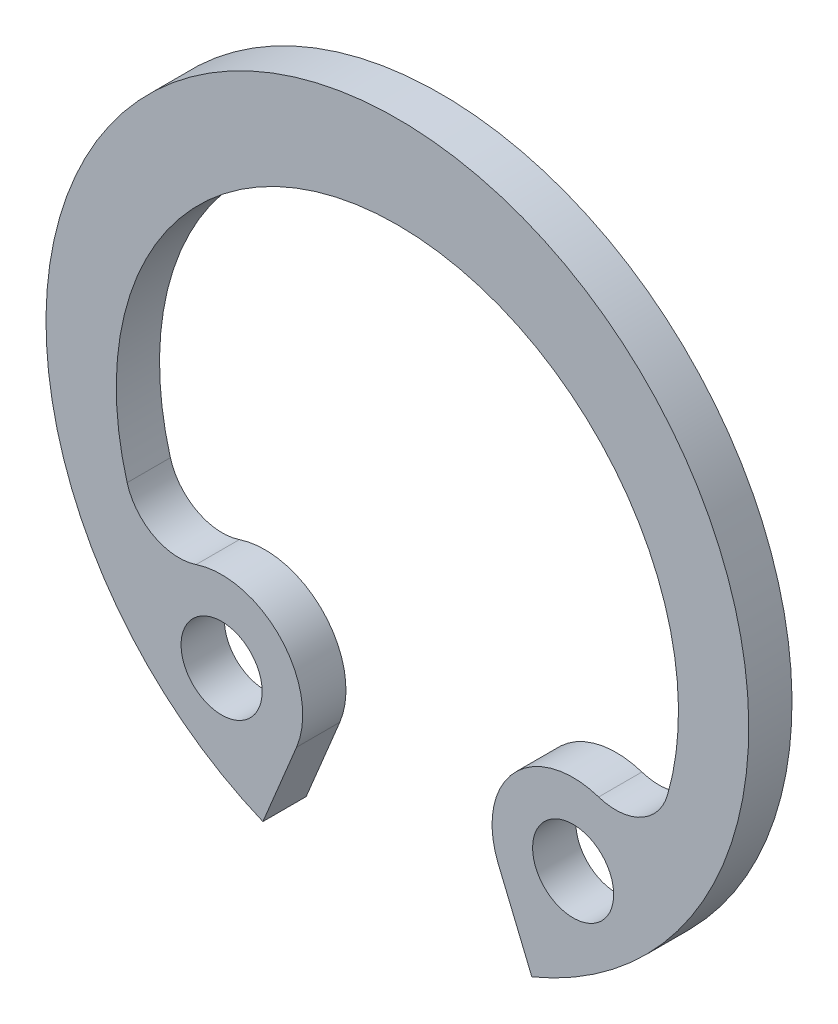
from build123d import *

# Parameters (mm, degrees)
SKETCH1_R  = 0.75
BODY_DEPTH = 0.8


with BuildPart() as part:
    # Sketch1 → Body (new body)
    with BuildSketch(Plane.XY):
        with BuildLine():
            Line((1.865360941, -4.503379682), (2.48744231, -6.005216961))
            ThreePointArc((2.48744231, -6.005216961), (0, 6.5), (-2.48744231, -6.005216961))
            Line((-2.48744231, -6.005216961), (-1.865360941, -4.503379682))
            ThreePointArc((-1.865360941, -4.503379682), (-2.152695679, -2.907918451), (-3.723088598, -2.5055208))
            ThreePointArc((-3.723088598, -2.5055208), (-4.504717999, -2.440543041), (-4.999049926, -1.831607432))
            ThreePointArc((-4.999049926, -1.831607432), (0, 4.8), (4.999049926, -1.831607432))
            ThreePointArc((4.999049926, -1.831607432), (4.504717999, -2.440543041), (3.723088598, -2.5055208))
            ThreePointArc((3.723088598, -2.5055208), (2.152695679, -2.907918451), (1.865360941, -4.503379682))
        make_face()
        with Locations(Location((3.25118024, -3.929354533, 0), (0, 0, 180))):
            Circle(SKETCH1_R, mode=Mode.SUBTRACT)
        with Locations((-3.25118024, -3.929354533)):
            Circle(SKETCH1_R, mode=Mode.SUBTRACT)
    extrude(amount=-BODY_DEPTH)


solid = part.part
